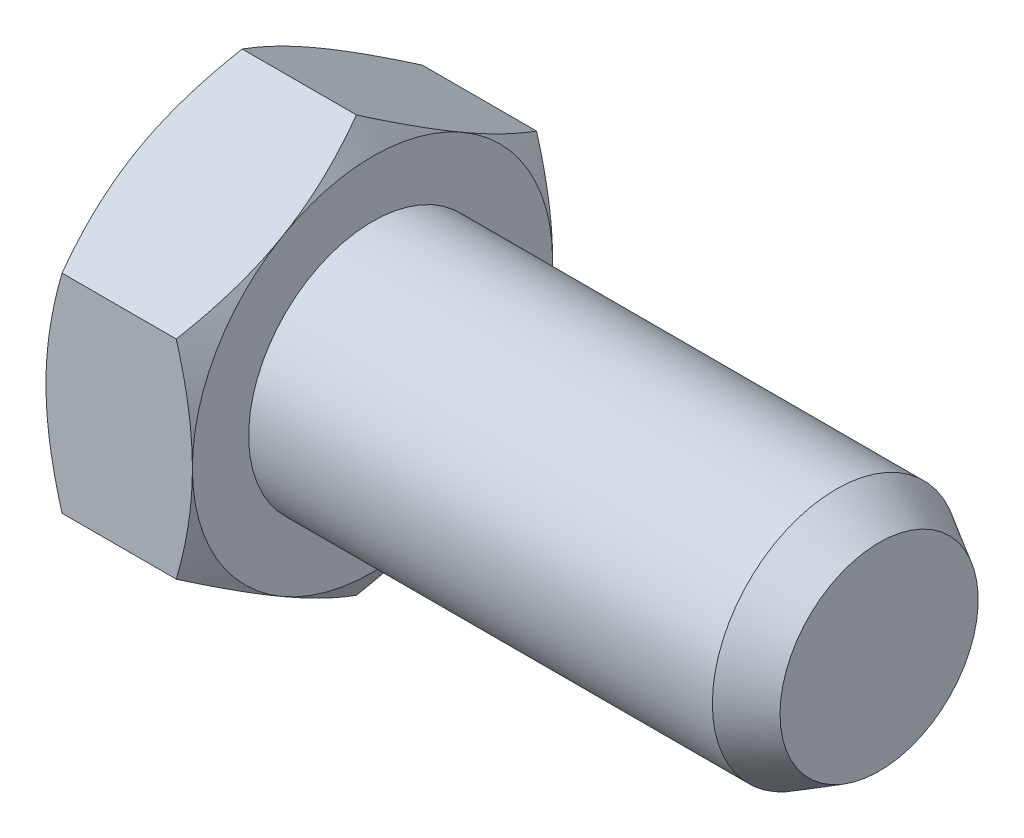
from build123d import *

# Parameters (mm, degrees)
EXTRUDE1_DEPTH = 1.3
SKETCH4_W      = 0.6
SKETCH4_H      = 1.28
CHAMFER1_SIZE  = 0.22
CHAMFER1_SIZE2 = 0.381051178


with BuildPart() as part:
    # Sketch1 → Revolve1 (revolve)
    with BuildSketch(Plane.XY, mode=Mode.PRIVATE) as revolve1_sk:
        Polygon((0, 0), (0, 1.4), (1.3, 1.4), (1.3, 1.1), (5.8, 1.1), (5.8, 0), align=None)
    revolve(revolve1_sk.sketch.rotate(Axis((13.107885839, 0, 0), (-1, 0, 0)), 90), axis=Axis((13.107885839, 0, 0), (-1, 0, 0)))

    # Sketch2 → Extrude1 (add)
    with BuildSketch(Plane.ZY):
        Polygon((1.6, -0.923760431), (1.6, 0.923760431), (0, 1.847520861), (-1.6, 0.923760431), (-1.6, -0.923760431), (0, -1.847520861), align=None)
    extrude(amount=-EXTRUDE1_DEPTH)

    # Sketch3 → Cut-Revolve2 (revolve, cut)
    with BuildSketch(Plane(origin=(0, 0, 0), x_dir=(1, 0, 0), z_dir=(0, 1, 0))):
        Polygon((-0.923760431, 0), (0.65, 2.725833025), (1.3, 1.6), (1.3, 3.225833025), (-1.023760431, 3.225833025), (-1.023760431, 0), align=None)
    revolve(axis=Axis((0, 0, 0), (-1, 0, 0)), mode=Mode.SUBTRACT)

    # Sketch4 → Cut-Revolve3 (revolve, cut)
    with BuildSketch(Plane.XY, mode=Mode.PRIVATE) as cut_revolve3_sk:
        with Locations((0.1, 0.64)):
            Rectangle(SKETCH4_W, SKETCH4_H)
    revolve(cut_revolve3_sk.sketch.rotate(Axis((0, 0, 0), (1, 0, 0)), 180), axis=Axis((0, 0, 0), (1, 0, 0)), mode=Mode.SUBTRACT)

    # Chamfer1
    chamfer1_edges = [part.edges().sort_by_distance(p)[0] for p in [
        (5.8, 0, 1.1),
    ]]
    chamfer1_side = [part.faces().sort_by_distance(p)[0] for p in [
        (5.8, 0, 0),
    ]]
    chamfer(chamfer1_edges, length=CHAMFER1_SIZE, length2=CHAMFER1_SIZE2, reference=chamfer1_side[0])


solid = part.part
